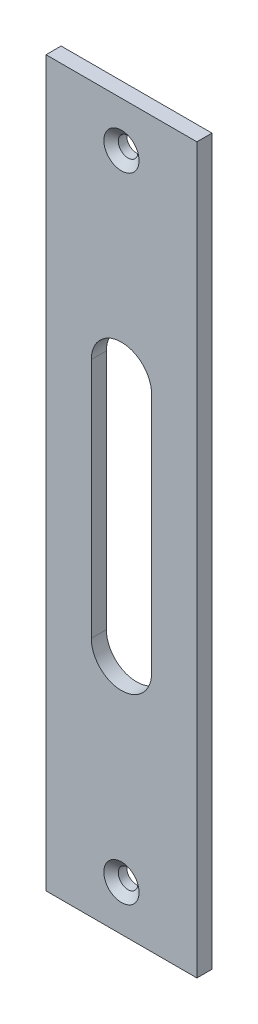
ISO-10303-21;
HEADER;
FILE_DESCRIPTION(('STEP AP214'),'2;1');
FILE_NAME('part.step','',(''),(''),'','','');
FILE_SCHEMA(('AUTOMOTIVE_DESIGN { 1 0 10303 214 1 1 1 1 }'));
ENDSEC;
DATA;
#1=APPLICATION_CONTEXT('core data for automotive mechanical design processes');
#2=APPLICATION_PROTOCOL_DEFINITION('international standard','automotive_design',2000,#1);
#3=PRODUCT_CONTEXT('',#1,'mechanical');
#4=PRODUCT('Part','Part','',(#3));
#5=PRODUCT_RELATED_PRODUCT_CATEGORY('part','',(#4));
#6=PRODUCT_DEFINITION_FORMATION('','',#4);
#7=PRODUCT_DEFINITION_CONTEXT('part definition',#1,'design');
#8=PRODUCT_DEFINITION('design','',#6,#7);
#9=PRODUCT_DEFINITION_SHAPE('','',#8);
#10=(LENGTH_UNIT() NAMED_UNIT(*) SI_UNIT(.MILLI.,.METRE.));
#11=(NAMED_UNIT(*) PLANE_ANGLE_UNIT() SI_UNIT($,.RADIAN.));
#12=(NAMED_UNIT(*) SI_UNIT($,.STERADIAN.) SOLID_ANGLE_UNIT());
#13=UNCERTAINTY_MEASURE_WITH_UNIT(LENGTH_MEASURE(1.E-05),#10,'distance_accuracy_value','');
#14=(GEOMETRIC_REPRESENTATION_CONTEXT(3) GLOBAL_UNCERTAINTY_ASSIGNED_CONTEXT((#13)) GLOBAL_UNIT_ASSIGNED_CONTEXT((#10,
#11,#12)) REPRESENTATION_CONTEXT('',''));
#15=CARTESIAN_POINT('',(0.,0.,0.));
#16=DIRECTION('',(0.,0.,1.));
#17=DIRECTION('',(1.,0.,0.));
#18=AXIS2_PLACEMENT_3D('',#15,#16,#17);
#19=CARTESIAN_POINT('',(-7.9375,-38.1,79.4235817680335));
#20=DIRECTION('',(0.,1.,0.));
#21=DIRECTION('',(0.,0.,1.));
#22=AXIS2_PLACEMENT_3D('',#19,#20,#21);
#23=PLANE('',#22);
#24=DIRECTION('',(1.,0.,0.));
#25=VECTOR('',#24,1.);
#26=CARTESIAN_POINT('',(-7.9375,-38.1,1.58749999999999));
#27=LINE('',#26,#25);
#28=CARTESIAN_POINT('',(-7.9375,-38.1,1.58749999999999));
#29=VERTEX_POINT('',#28);
#30=CARTESIAN_POINT('',(7.93749999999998,-38.1,1.58749999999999));
#31=VERTEX_POINT('',#30);
#32=EDGE_CURVE('E148',#29,#31,#27,.T.);
#33=ORIENTED_EDGE('',*,*,#32,.F.);
#34=DIRECTION('',(0.,0.,-1.));
#35=VECTOR('',#34,1.);
#36=CARTESIAN_POINT('',(-7.9375,-38.1,79.4235817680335));
#37=LINE('',#36,#35);
#38=CARTESIAN_POINT('',(-7.9375,-38.1,0.));
#39=VERTEX_POINT('',#38);
#40=EDGE_CURVE('E32',#29,#39,#37,.T.);
#41=ORIENTED_EDGE('',*,*,#40,.T.);
#42=DIRECTION('',(1.,0.,0.));
#43=VECTOR('',#42,1.);
#44=CARTESIAN_POINT('',(-7.9375,-38.1,0.));
#45=LINE('',#44,#43);
#46=CARTESIAN_POINT('',(7.93749999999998,-38.1,0.));
#47=VERTEX_POINT('',#46);
#48=EDGE_CURVE('E143',#39,#47,#45,.T.);
#49=ORIENTED_EDGE('',*,*,#48,.T.);
#50=DIRECTION('',(0.,0.,-1.));
#51=VECTOR('',#50,1.);
#52=CARTESIAN_POINT('',(7.93749999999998,-38.1,79.4235817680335));
#53=LINE('',#52,#51);
#54=EDGE_CURVE('E142',#31,#47,#53,.T.);
#55=ORIENTED_EDGE('',*,*,#54,.F.);
#56=EDGE_LOOP('',(#33,#41,#49,#55));
#57=FACE_BOUND('',#56,.T.);
#58=ADVANCED_FACE('F28',(#57),#23,.F.);
#59=CARTESIAN_POINT('',(7.93749999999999,38.1,79.4235817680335));
#60=DIRECTION('',(-1.,0.,0.));
#61=DIRECTION('',(0.,-1.,0.));
#62=AXIS2_PLACEMENT_3D('',#59,#60,#61);
#63=PLANE('',#62);
#64=DIRECTION('',(0.,1.,0.));
#65=VECTOR('',#64,1.);
#66=CARTESIAN_POINT('',(7.93749999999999,38.1,1.58749999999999));
#67=LINE('',#66,#65);
#68=CARTESIAN_POINT('',(7.93749999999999,38.1,1.58749999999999));
#69=VERTEX_POINT('',#68);
#70=EDGE_CURVE('E37',#31,#69,#67,.T.);
#71=ORIENTED_EDGE('',*,*,#70,.F.);
#72=ORIENTED_EDGE('',*,*,#54,.T.);
#73=DIRECTION('',(0.,1.,0.));
#74=VECTOR('',#73,1.);
#75=CARTESIAN_POINT('',(7.93749999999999,38.1,0.));
#76=LINE('',#75,#74);
#77=CARTESIAN_POINT('',(7.93749999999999,38.1,0.));
#78=VERTEX_POINT('',#77);
#79=EDGE_CURVE('E139',#47,#78,#76,.T.);
#80=ORIENTED_EDGE('',*,*,#79,.T.);
#81=DIRECTION('',(0.,0.,-1.));
#82=VECTOR('',#81,1.);
#83=CARTESIAN_POINT('',(7.93749999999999,38.1,79.4235817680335));
#84=LINE('',#83,#82);
#85=EDGE_CURVE('E138',#69,#78,#84,.T.);
#86=ORIENTED_EDGE('',*,*,#85,.F.);
#87=EDGE_LOOP('',(#71,#72,#80,#86));
#88=FACE_BOUND('',#87,.T.);
#89=ADVANCED_FACE('F170',(#88),#63,.F.);
#90=CARTESIAN_POINT('',(7.93749999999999,38.1,79.4235817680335));
#91=DIRECTION('',(0.,-1.,0.));
#92=DIRECTION('',(0.,0.,-1.));
#93=AXIS2_PLACEMENT_3D('',#90,#91,#92);
#94=PLANE('',#93);
#95=DIRECTION('',(-1.,0.,0.));
#96=VECTOR('',#95,1.);
#97=CARTESIAN_POINT('',(7.93749999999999,38.1,1.58749999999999));
#98=LINE('',#97,#96);
#99=CARTESIAN_POINT('',(-7.9375,38.1,1.58749999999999));
#100=VERTEX_POINT('',#99);
#101=EDGE_CURVE('E11',#69,#100,#98,.T.);
#102=ORIENTED_EDGE('',*,*,#101,.F.);
#103=ORIENTED_EDGE('',*,*,#85,.T.);
#104=DIRECTION('',(-1.,0.,0.));
#105=VECTOR('',#104,1.);
#106=CARTESIAN_POINT('',(7.93749999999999,38.1,0.));
#107=LINE('',#106,#105);
#108=CARTESIAN_POINT('',(-7.9375,38.1,0.));
#109=VERTEX_POINT('',#108);
#110=EDGE_CURVE('E135',#78,#109,#107,.T.);
#111=ORIENTED_EDGE('',*,*,#110,.T.);
#112=DIRECTION('',(0.,0.,-1.));
#113=VECTOR('',#112,1.);
#114=CARTESIAN_POINT('',(-7.9375,38.1,79.4235817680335));
#115=LINE('',#114,#113);
#116=EDGE_CURVE('E134',#100,#109,#115,.T.);
#117=ORIENTED_EDGE('',*,*,#116,.F.);
#118=EDGE_LOOP('',(#102,#103,#111,#117));
#119=FACE_BOUND('',#118,.T.);
#120=ADVANCED_FACE('F161',(#119),#94,.F.);
#121=CARTESIAN_POINT('',(-7.9375,-38.1,79.4235817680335));
#122=DIRECTION('',(1.,0.,0.));
#123=DIRECTION('',(0.,0.,-1.));
#124=AXIS2_PLACEMENT_3D('',#121,#122,#123);
#125=PLANE('',#124);
#126=DIRECTION('',(0.,-1.,0.));
#127=VECTOR('',#126,1.);
#128=CARTESIAN_POINT('',(-7.9375,-38.1,1.58749999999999));
#129=LINE('',#128,#127);
#130=EDGE_CURVE('E133',#100,#29,#129,.T.);
#131=ORIENTED_EDGE('',*,*,#130,.F.);
#132=ORIENTED_EDGE('',*,*,#116,.T.);
#133=DIRECTION('',(0.,-1.,0.));
#134=VECTOR('',#133,1.);
#135=CARTESIAN_POINT('',(-7.9375,-38.1,0.));
#136=LINE('',#135,#134);
#137=EDGE_CURVE('E130',#109,#39,#136,.T.);
#138=ORIENTED_EDGE('',*,*,#137,.T.);
#139=ORIENTED_EDGE('',*,*,#40,.F.);
#140=EDGE_LOOP('',(#131,#132,#138,#139));
#141=FACE_BOUND('',#140,.T.);
#142=ADVANCED_FACE('F156',(#141),#125,.F.);
#143=CARTESIAN_POINT('',(-7.9375,-38.1,0.));
#144=DIRECTION('',(0.,0.,1.));
#145=DIRECTION('',(1.,0.,0.));
#146=AXIS2_PLACEMENT_3D('',#143,#144,#145);
#147=PLANE('',#146);
#148=CARTESIAN_POINT('',(0.,-33.3375,0.));
#149=DIRECTION('',(0.,0.,1.));
#150=DIRECTION('',(1.,0.,0.));
#151=AXIS2_PLACEMENT_3D('',#148,#149,#150);
#152=CIRCLE('',#151,1.0287);
#153=CARTESIAN_POINT('',(1.0287,-33.3375,0.));
#154=VERTEX_POINT('',#153);
#155=EDGE_CURVE('E215',#154,#154,#152,.T.);
#156=ORIENTED_EDGE('',*,*,#155,.T.);
#157=EDGE_LOOP('',(#156));
#158=FACE_BOUND('',#157,.T.);
#159=CARTESIAN_POINT('',(0.,33.3375,0.));
#160=DIRECTION('',(0.,0.,1.));
#161=DIRECTION('',(1.,0.,0.));
#162=AXIS2_PLACEMENT_3D('',#159,#160,#161);
#163=CIRCLE('',#162,1.0287);
#164=CARTESIAN_POINT('',(1.0287,33.3375,0.));
#165=VERTEX_POINT('',#164);
#166=EDGE_CURVE('E222',#165,#165,#163,.T.);
#167=ORIENTED_EDGE('',*,*,#166,.T.);
#168=EDGE_LOOP('',(#167));
#169=FACE_BOUND('',#168,.T.);
#170=DIRECTION('',(0.,1.,0.));
#171=VECTOR('',#170,1.);
#172=CARTESIAN_POINT('',(3.175,12.7,0.));
#173=LINE('',#172,#171);
#174=CARTESIAN_POINT('',(3.175,-12.7,0.));
#175=VERTEX_POINT('',#174);
#176=CARTESIAN_POINT('',(3.175,12.7,0.));
#177=VERTEX_POINT('',#176);
#178=EDGE_CURVE('E123',#175,#177,#173,.T.);
#179=ORIENTED_EDGE('',*,*,#178,.T.);
#180=CARTESIAN_POINT('',(0.,12.7,0.));
#181=DIRECTION('',(0.,0.,1.));
#182=DIRECTION('',(-1.,0.,0.));
#183=AXIS2_PLACEMENT_3D('',#180,#181,#182);
#184=CIRCLE('',#183,3.175);
#185=CARTESIAN_POINT('',(-3.175,12.7,0.));
#186=VERTEX_POINT('',#185);
#187=EDGE_CURVE('E114',#177,#186,#184,.T.);
#188=ORIENTED_EDGE('',*,*,#187,.T.);
#189=DIRECTION('',(0.,-1.,0.));
#190=VECTOR('',#189,1.);
#191=CARTESIAN_POINT('',(-3.175,-12.7,0.));
#192=LINE('',#191,#190);
#193=CARTESIAN_POINT('',(-3.175,-12.7,0.));
#194=VERTEX_POINT('',#193);
#195=EDGE_CURVE('E120',#186,#194,#192,.T.);
#196=ORIENTED_EDGE('',*,*,#195,.T.);
#197=CARTESIAN_POINT('',(0.,-12.7,0.));
#198=DIRECTION('',(0.,0.,1.));
#199=DIRECTION('',(-1.,0.,0.));
#200=AXIS2_PLACEMENT_3D('',#197,#198,#199);
#201=CIRCLE('',#200,3.175);
#202=EDGE_CURVE('E45',#194,#175,#201,.T.);
#203=ORIENTED_EDGE('',*,*,#202,.T.);
#204=EDGE_LOOP('',(#179,#188,#196,#203));
#205=FACE_BOUND('',#204,.T.);
#206=ORIENTED_EDGE('',*,*,#48,.F.);
#207=ORIENTED_EDGE('',*,*,#137,.F.);
#208=ORIENTED_EDGE('',*,*,#110,.F.);
#209=ORIENTED_EDGE('',*,*,#79,.F.);
#210=EDGE_LOOP('',(#206,#207,#208,#209));
#211=FACE_BOUND('',#210,.T.);
#212=ADVANCED_FACE('F165',(#158,#169,#205,#211),#147,.F.);
#213=CARTESIAN_POINT('',(0.,114.3,1.5875));
#214=DIRECTION('',(0.,0.,1.));
#215=DIRECTION('',(0.,1.,0.));
#216=AXIS2_PLACEMENT_3D('',#213,#214,#215);
#217=PLANE('',#216);
#218=CARTESIAN_POINT('',(0.,-33.3375,1.5875));
#219=DIRECTION('',(0.,0.,1.));
#220=DIRECTION('',(1.,0.,0.));
#221=AXIS2_PLACEMENT_3D('',#218,#219,#220);
#222=CIRCLE('',#221,1.8542);
#223=CARTESIAN_POINT('',(1.8542,-33.3375,1.5875));
#224=VERTEX_POINT('',#223);
#225=EDGE_CURVE('E219',#224,#224,#222,.T.);
#226=ORIENTED_EDGE('',*,*,#225,.F.);
#227=EDGE_LOOP('',(#226));
#228=FACE_BOUND('',#227,.T.);
#229=CARTESIAN_POINT('',(0.,33.3375,1.5875));
#230=DIRECTION('',(0.,0.,1.));
#231=DIRECTION('',(1.,0.,0.));
#232=AXIS2_PLACEMENT_3D('',#229,#230,#231);
#233=CIRCLE('',#232,1.8542);
#234=CARTESIAN_POINT('',(1.85420000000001,33.3375,1.5875));
#235=VERTEX_POINT('',#234);
#236=EDGE_CURVE('E231',#235,#235,#233,.T.);
#237=ORIENTED_EDGE('',*,*,#236,.F.);
#238=EDGE_LOOP('',(#237));
#239=FACE_BOUND('',#238,.T.);
#240=CARTESIAN_POINT('',(0.,12.7,1.5875));
#241=DIRECTION('',(0.,0.,1.));
#242=DIRECTION('',(-1.,0.,0.));
#243=AXIS2_PLACEMENT_3D('',#240,#241,#242);
#244=CIRCLE('',#243,3.175);
#245=CARTESIAN_POINT('',(3.175,12.7,1.5875));
#246=VERTEX_POINT('',#245);
#247=CARTESIAN_POINT('',(-3.175,12.7,1.5875));
#248=VERTEX_POINT('',#247);
#249=EDGE_CURVE('E53',#246,#248,#244,.T.);
#250=ORIENTED_EDGE('',*,*,#249,.F.);
#251=DIRECTION('',(0.,1.,0.));
#252=VECTOR('',#251,1.);
#253=CARTESIAN_POINT('',(3.175,12.7,1.5875));
#254=LINE('',#253,#252);
#255=CARTESIAN_POINT('',(3.175,-12.7,1.5875));
#256=VERTEX_POINT('',#255);
#257=EDGE_CURVE('E112',#256,#246,#254,.T.);
#258=ORIENTED_EDGE('',*,*,#257,.F.);
#259=CARTESIAN_POINT('',(0.,-12.7,1.5875));
#260=DIRECTION('',(0.,0.,1.));
#261=DIRECTION('',(-1.,0.,0.));
#262=AXIS2_PLACEMENT_3D('',#259,#260,#261);
#263=CIRCLE('',#262,3.175);
#264=CARTESIAN_POINT('',(-3.17499999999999,-12.7,1.5875));
#265=VERTEX_POINT('',#264);
#266=EDGE_CURVE('E97',#265,#256,#263,.T.);
#267=ORIENTED_EDGE('',*,*,#266,.F.);
#268=DIRECTION('',(0.,-1.,0.));
#269=VECTOR('',#268,1.);
#270=CARTESIAN_POINT('',(-3.175,-12.7,1.5875));
#271=LINE('',#270,#269);
#272=EDGE_CURVE('E106',#248,#265,#271,.T.);
#273=ORIENTED_EDGE('',*,*,#272,.F.);
#274=EDGE_LOOP('',(#250,#258,#267,#273));
#275=FACE_BOUND('',#274,.T.);
#276=ORIENTED_EDGE('',*,*,#130,.T.);
#277=ORIENTED_EDGE('',*,*,#32,.T.);
#278=ORIENTED_EDGE('',*,*,#70,.T.);
#279=ORIENTED_EDGE('',*,*,#101,.T.);
#280=EDGE_LOOP('',(#276,#277,#278,#279));
#281=FACE_BOUND('',#280,.T.);
#282=ADVANCED_FACE('F30',(#228,#239,#275,#281),#217,.T.);
#283=CARTESIAN_POINT('',(0.,12.7,0.));
#284=DIRECTION('',(0.,0.,1.));
#285=DIRECTION('',(1.,0.,0.));
#286=AXIS2_PLACEMENT_3D('',#283,#284,#285);
#287=CYLINDRICAL_SURFACE('',#286,3.175);
#288=ORIENTED_EDGE('',*,*,#249,.T.);
#289=DIRECTION('',(0.,0.,1.));
#290=VECTOR('',#289,1.);
#291=CARTESIAN_POINT('',(-3.175,12.7,0.));
#292=LINE('',#291,#290);
#293=EDGE_CURVE('E103',#186,#248,#292,.T.);
#294=ORIENTED_EDGE('',*,*,#293,.F.);
#295=ORIENTED_EDGE('',*,*,#187,.F.);
#296=DIRECTION('',(0.,0.,1.));
#297=VECTOR('',#296,1.);
#298=CARTESIAN_POINT('',(3.175,12.7,0.));
#299=LINE('',#298,#297);
#300=EDGE_CURVE('E126',#177,#246,#299,.T.);
#301=ORIENTED_EDGE('',*,*,#300,.T.);
#302=EDGE_LOOP('',(#288,#294,#295,#301));
#303=FACE_BOUND('',#302,.T.);
#304=ADVANCED_FACE('F184',(#303),#287,.F.);
#305=CARTESIAN_POINT('',(3.175,12.7,0.));
#306=DIRECTION('',(1.,0.,0.));
#307=DIRECTION('',(0.,0.,-1.));
#308=AXIS2_PLACEMENT_3D('',#305,#306,#307);
#309=PLANE('',#308);
#310=ORIENTED_EDGE('',*,*,#257,.T.);
#311=ORIENTED_EDGE('',*,*,#300,.F.);
#312=ORIENTED_EDGE('',*,*,#178,.F.);
#313=DIRECTION('',(0.,0.,1.));
#314=VECTOR('',#313,1.);
#315=CARTESIAN_POINT('',(3.175,-12.7,0.));
#316=LINE('',#315,#314);
#317=EDGE_CURVE('E102',#175,#256,#316,.T.);
#318=ORIENTED_EDGE('',*,*,#317,.T.);
#319=EDGE_LOOP('',(#310,#311,#312,#318));
#320=FACE_BOUND('',#319,.T.);
#321=ADVANCED_FACE('F187',(#320),#309,.F.);
#322=CARTESIAN_POINT('',(0.,-12.7,0.));
#323=DIRECTION('',(0.,0.,1.));
#324=DIRECTION('',(1.,0.,0.));
#325=AXIS2_PLACEMENT_3D('',#322,#323,#324);
#326=CYLINDRICAL_SURFACE('',#325,3.175);
#327=ORIENTED_EDGE('',*,*,#266,.T.);
#328=ORIENTED_EDGE('',*,*,#317,.F.);
#329=ORIENTED_EDGE('',*,*,#202,.F.);
#330=DIRECTION('',(0.,0.,1.));
#331=VECTOR('',#330,1.);
#332=CARTESIAN_POINT('',(-3.17499999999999,-12.7,0.));
#333=LINE('',#332,#331);
#334=EDGE_CURVE('E93',#194,#265,#333,.T.);
#335=ORIENTED_EDGE('',*,*,#334,.T.);
#336=EDGE_LOOP('',(#327,#328,#329,#335));
#337=FACE_BOUND('',#336,.T.);
#338=ADVANCED_FACE('F95',(#337),#326,.F.);
#339=CARTESIAN_POINT('',(-3.175,-12.7,0.));
#340=DIRECTION('',(-1.,0.,0.));
#341=DIRECTION('',(0.,0.,1.));
#342=AXIS2_PLACEMENT_3D('',#339,#340,#341);
#343=PLANE('',#342);
#344=ORIENTED_EDGE('',*,*,#272,.T.);
#345=ORIENTED_EDGE('',*,*,#334,.F.);
#346=ORIENTED_EDGE('',*,*,#195,.F.);
#347=ORIENTED_EDGE('',*,*,#293,.T.);
#348=EDGE_LOOP('',(#344,#345,#346,#347));
#349=FACE_BOUND('',#348,.T.);
#350=ADVANCED_FACE('F107',(#349),#343,.F.);
#351=CARTESIAN_POINT('',(0.,33.3375,1.5875));
#352=DIRECTION('',(0.,0.,1.));
#353=DIRECTION('',(1.,0.,0.));
#354=AXIS2_PLACEMENT_3D('',#351,#352,#353);
#355=CONICAL_SURFACE('',#354,1.8542,0.872664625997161);
#356=CARTESIAN_POINT('',(0.,33.3375,0.894823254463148));
#357=DIRECTION('',(0.,0.,1.));
#358=DIRECTION('',(1.,0.,0.));
#359=AXIS2_PLACEMENT_3D('',#356,#357,#358);
#360=CIRCLE('',#359,1.0287);
#361=CARTESIAN_POINT('',(1.0287,33.3375,0.894823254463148));
#362=VERTEX_POINT('',#361);
#363=EDGE_CURVE('E228',#362,#362,#360,.T.);
#364=ORIENTED_EDGE('',*,*,#363,.F.);
#365=EDGE_LOOP('',(#364));
#366=FACE_BOUND('',#365,.T.);
#367=ORIENTED_EDGE('',*,*,#236,.T.);
#368=EDGE_LOOP('',(#367));
#369=FACE_BOUND('',#368,.T.);
#370=ADVANCED_FACE('F190',(#366,#369),#355,.F.);
#371=CARTESIAN_POINT('',(0.,33.3375,1.5875));
#372=DIRECTION('',(0.,0.,1.));
#373=DIRECTION('',(1.,0.,0.));
#374=AXIS2_PLACEMENT_3D('',#371,#372,#373);
#375=CYLINDRICAL_SURFACE('',#374,1.0287);
#376=ORIENTED_EDGE('',*,*,#166,.F.);
#377=EDGE_LOOP('',(#376));
#378=FACE_BOUND('',#377,.T.);
#379=ORIENTED_EDGE('',*,*,#363,.T.);
#380=EDGE_LOOP('',(#379));
#381=FACE_BOUND('',#380,.T.);
#382=ADVANCED_FACE('F198',(#378,#381),#375,.F.);
#383=CARTESIAN_POINT('',(0.,-33.3375,1.5875));
#384=DIRECTION('',(0.,0.,1.));
#385=DIRECTION('',(1.,0.,0.));
#386=AXIS2_PLACEMENT_3D('',#383,#384,#385);
#387=CONICAL_SURFACE('',#386,1.8542,0.872664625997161);
#388=CARTESIAN_POINT('',(0.,-33.3375,0.894823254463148));
#389=DIRECTION('',(0.,0.,1.));
#390=DIRECTION('',(1.,0.,0.));
#391=AXIS2_PLACEMENT_3D('',#388,#389,#390);
#392=CIRCLE('',#391,1.0287);
#393=CARTESIAN_POINT('',(1.0287,-33.3375,0.894823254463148));
#394=VERTEX_POINT('',#393);
#395=EDGE_CURVE('E218',#394,#394,#392,.T.);
#396=ORIENTED_EDGE('',*,*,#395,.F.);
#397=EDGE_LOOP('',(#396));
#398=FACE_BOUND('',#397,.T.);
#399=ORIENTED_EDGE('',*,*,#225,.T.);
#400=EDGE_LOOP('',(#399));
#401=FACE_BOUND('',#400,.T.);
#402=ADVANCED_FACE('F202',(#398,#401),#387,.F.);
#403=CARTESIAN_POINT('',(0.,-33.3375,1.5875));
#404=DIRECTION('',(0.,0.,1.));
#405=DIRECTION('',(1.,0.,0.));
#406=AXIS2_PLACEMENT_3D('',#403,#404,#405);
#407=CYLINDRICAL_SURFACE('',#406,1.0287);
#408=ORIENTED_EDGE('',*,*,#155,.F.);
#409=EDGE_LOOP('',(#408));
#410=FACE_BOUND('',#409,.T.);
#411=ORIENTED_EDGE('',*,*,#395,.T.);
#412=EDGE_LOOP('',(#411));
#413=FACE_BOUND('',#412,.T.);
#414=ADVANCED_FACE('F206',(#410,#413),#407,.F.);
#415=CLOSED_SHELL('',(#58,#89,#120,#142,#212,#282,#304,#321,#338,#350,#370,#382,#402,#414));
#416=MANIFOLD_SOLID_BREP('B2',#415);
#417=ADVANCED_BREP_SHAPE_REPRESENTATION('',(#18,#416),#14);
#418=SHAPE_DEFINITION_REPRESENTATION(#9,#417);
ENDSEC;
END-ISO-10303-21;
